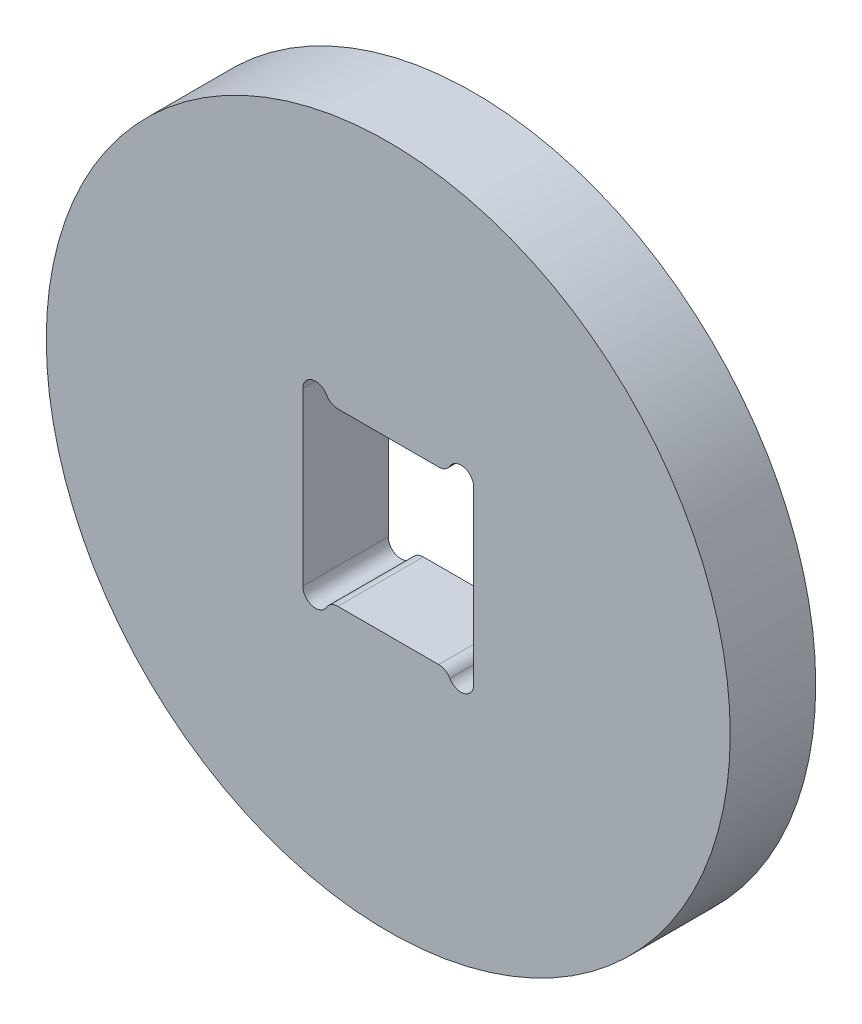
ISO-10303-21;
HEADER;
FILE_DESCRIPTION(('STEP AP214'),'2;1');
FILE_NAME('part.step','',(''),(''),'','','');
FILE_SCHEMA(('AUTOMOTIVE_DESIGN { 1 0 10303 214 1 1 1 1 }'));
ENDSEC;
DATA;
#1=APPLICATION_CONTEXT('core data for automotive mechanical design processes');
#2=APPLICATION_PROTOCOL_DEFINITION('international standard','automotive_design',2000,#1);
#3=PRODUCT_CONTEXT('',#1,'mechanical');
#4=PRODUCT('Part','Part','',(#3));
#5=PRODUCT_RELATED_PRODUCT_CATEGORY('part','',(#4));
#6=PRODUCT_DEFINITION_FORMATION('','',#4);
#7=PRODUCT_DEFINITION_CONTEXT('part definition',#1,'design');
#8=PRODUCT_DEFINITION('design','',#6,#7);
#9=PRODUCT_DEFINITION_SHAPE('','',#8);
#10=(LENGTH_UNIT() NAMED_UNIT(*) SI_UNIT(.MILLI.,.METRE.));
#11=(NAMED_UNIT(*) PLANE_ANGLE_UNIT() SI_UNIT($,.RADIAN.));
#12=(NAMED_UNIT(*) SI_UNIT($,.STERADIAN.) SOLID_ANGLE_UNIT());
#13=UNCERTAINTY_MEASURE_WITH_UNIT(LENGTH_MEASURE(1.E-05),#10,'distance_accuracy_value','');
#14=(GEOMETRIC_REPRESENTATION_CONTEXT(3) GLOBAL_UNCERTAINTY_ASSIGNED_CONTEXT((#13)) GLOBAL_UNIT_ASSIGNED_CONTEXT((#10,
#11,#12)) REPRESENTATION_CONTEXT('',''));
#15=CARTESIAN_POINT('',(0.,0.,0.));
#16=DIRECTION('',(0.,0.,1.));
#17=DIRECTION('',(1.,0.,0.));
#18=AXIS2_PLACEMENT_3D('',#15,#16,#17);
#19=CARTESIAN_POINT('',(0.,0.,10.));
#20=DIRECTION('',(0.,0.,1.));
#21=DIRECTION('',(1.,0.,0.));
#22=AXIS2_PLACEMENT_3D('',#19,#20,#21);
#23=PLANE('',#22);
#24=CARTESIAN_POINT('',(0.,0.,10.));
#25=DIRECTION('',(0.,0.,1.));
#26=DIRECTION('',(1.,0.,0.));
#27=AXIS2_PLACEMENT_3D('',#24,#25,#26);
#28=CIRCLE('',#27,40.);
#29=CARTESIAN_POINT('',(40.,0.,10.));
#30=VERTEX_POINT('',#29);
#31=EDGE_CURVE('E11',#30,#30,#28,.T.);
#32=ORIENTED_EDGE('',*,*,#31,.T.);
#33=EDGE_LOOP('',(#32));
#34=FACE_BOUND('',#33,.T.);
#35=DIRECTION('',(0.,-1.,0.));
#36=VECTOR('',#35,1.);
#37=CARTESIAN_POINT('',(-10.,-10.0000000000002,10.));
#38=LINE('',#37,#36);
#39=CARTESIAN_POINT('',(-10.,10.,10.));
#40=VERTEX_POINT('',#39);
#41=CARTESIAN_POINT('',(-10.,-10.0000000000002,10.));
#42=VERTEX_POINT('',#41);
#43=EDGE_CURVE('E144',#40,#42,#38,.T.);
#44=ORIENTED_EDGE('',*,*,#43,.F.);
#45=CARTESIAN_POINT('',(-8.5,10.,10.));
#46=DIRECTION('',(0.,0.,1.));
#47=DIRECTION('',(1.,0.,0.));
#48=AXIS2_PLACEMENT_3D('',#45,#46,#47);
#49=CIRCLE('',#48,1.5);
#50=CARTESIAN_POINT('',(-7.20096189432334,10.75,10.));
#51=VERTEX_POINT('',#50);
#52=EDGE_CURVE('E135',#51,#40,#49,.T.);
#53=ORIENTED_EDGE('',*,*,#52,.F.);
#54=CARTESIAN_POINT('',(-5.90192378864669,11.5,10.));
#55=DIRECTION('',(0.,0.,-1.));
#56=DIRECTION('',(1.,0.,0.));
#57=AXIS2_PLACEMENT_3D('',#54,#55,#56);
#58=CIRCLE('',#57,1.5);
#59=CARTESIAN_POINT('',(-5.90192378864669,10.,10.));
#60=VERTEX_POINT('',#59);
#61=EDGE_CURVE('E187',#60,#51,#58,.T.);
#62=ORIENTED_EDGE('',*,*,#61,.F.);
#63=DIRECTION('',(-1.,0.,0.));
#64=VECTOR('',#63,1.);
#65=CARTESIAN_POINT('',(-5.90192378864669,10.,10.));
#66=LINE('',#65,#64);
#67=CARTESIAN_POINT('',(5.90192378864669,10.,10.));
#68=VERTEX_POINT('',#67);
#69=EDGE_CURVE('E184',#68,#60,#66,.T.);
#70=ORIENTED_EDGE('',*,*,#69,.F.);
#71=CARTESIAN_POINT('',(5.90192378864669,11.5,10.));
#72=DIRECTION('',(0.,0.,-1.));
#73=DIRECTION('',(1.,0.,0.));
#74=AXIS2_PLACEMENT_3D('',#71,#72,#73);
#75=CIRCLE('',#74,1.5);
#76=CARTESIAN_POINT('',(7.20096189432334,10.75,10.));
#77=VERTEX_POINT('',#76);
#78=EDGE_CURVE('E181',#77,#68,#75,.T.);
#79=ORIENTED_EDGE('',*,*,#78,.F.);
#80=CARTESIAN_POINT('',(8.5,10.,10.));
#81=DIRECTION('',(0.,0.,1.));
#82=DIRECTION('',(1.,0.,0.));
#83=AXIS2_PLACEMENT_3D('',#80,#81,#82);
#84=CIRCLE('',#83,1.5);
#85=CARTESIAN_POINT('',(10.,10.,10.));
#86=VERTEX_POINT('',#85);
#87=EDGE_CURVE('E178',#86,#77,#84,.T.);
#88=ORIENTED_EDGE('',*,*,#87,.F.);
#89=DIRECTION('',(0.,1.,0.));
#90=VECTOR('',#89,1.);
#91=CARTESIAN_POINT('',(10.,10.,10.));
#92=LINE('',#91,#90);
#93=CARTESIAN_POINT('',(10.,-10.0000000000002,10.));
#94=VERTEX_POINT('',#93);
#95=EDGE_CURVE('E175',#94,#86,#92,.T.);
#96=ORIENTED_EDGE('',*,*,#95,.F.);
#97=CARTESIAN_POINT('',(8.5,-10.0000000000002,10.));
#98=DIRECTION('',(0.,0.,1.));
#99=DIRECTION('',(1.,0.,0.));
#100=AXIS2_PLACEMENT_3D('',#97,#98,#99);
#101=CIRCLE('',#100,1.5);
#102=CARTESIAN_POINT('',(7.20096189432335,-10.7500000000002,10.));
#103=VERTEX_POINT('',#102);
#104=EDGE_CURVE('E172',#103,#94,#101,.T.);
#105=ORIENTED_EDGE('',*,*,#104,.F.);
#106=CARTESIAN_POINT('',(5.90192378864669,-11.5000000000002,10.));
#107=DIRECTION('',(0.,0.,-1.));
#108=DIRECTION('',(1.,0.,0.));
#109=AXIS2_PLACEMENT_3D('',#106,#107,#108);
#110=CIRCLE('',#109,1.5);
#111=CARTESIAN_POINT('',(5.90192378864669,-10.0000000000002,10.));
#112=VERTEX_POINT('',#111);
#113=EDGE_CURVE('E169',#112,#103,#110,.T.);
#114=ORIENTED_EDGE('',*,*,#113,.F.);
#115=DIRECTION('',(1.,0.,0.));
#116=VECTOR('',#115,1.);
#117=CARTESIAN_POINT('',(5.90192378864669,-10.0000000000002,10.));
#118=LINE('',#117,#116);
#119=CARTESIAN_POINT('',(-5.90192378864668,-10.0000000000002,10.));
#120=VERTEX_POINT('',#119);
#121=EDGE_CURVE('E166',#120,#112,#118,.T.);
#122=ORIENTED_EDGE('',*,*,#121,.F.);
#123=CARTESIAN_POINT('',(-5.90192378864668,-11.5000000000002,10.));
#124=DIRECTION('',(0.,0.,-1.));
#125=DIRECTION('',(1.,0.,0.));
#126=AXIS2_PLACEMENT_3D('',#123,#124,#125);
#127=CIRCLE('',#126,1.5);
#128=CARTESIAN_POINT('',(-7.20096189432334,-10.7500000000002,10.));
#129=VERTEX_POINT('',#128);
#130=EDGE_CURVE('E161',#129,#120,#127,.T.);
#131=ORIENTED_EDGE('',*,*,#130,.F.);
#132=CARTESIAN_POINT('',(-8.5,-10.0000000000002,10.));
#133=DIRECTION('',(0.,0.,1.));
#134=DIRECTION('',(1.,0.,0.));
#135=AXIS2_PLACEMENT_3D('',#132,#133,#134);
#136=CIRCLE('',#135,1.5);
#137=EDGE_CURVE('E157',#42,#129,#136,.T.);
#138=ORIENTED_EDGE('',*,*,#137,.F.);
#139=EDGE_LOOP('',(#44,#53,#62,#70,#79,#88,#96,#105,#114,#122,#131,#138));
#140=FACE_BOUND('',#139,.T.);
#141=ADVANCED_FACE('F45',(#34,#140),#23,.T.);
#142=CARTESIAN_POINT('',(0.,0.,0.));
#143=DIRECTION('',(0.,0.,1.));
#144=DIRECTION('',(1.,0.,0.));
#145=AXIS2_PLACEMENT_3D('',#142,#143,#144);
#146=PLANE('',#145);
#147=CARTESIAN_POINT('',(0.,0.,0.));
#148=DIRECTION('',(0.,0.,1.));
#149=DIRECTION('',(1.,0.,0.));
#150=AXIS2_PLACEMENT_3D('',#147,#148,#149);
#151=CIRCLE('',#150,40.);
#152=CARTESIAN_POINT('',(40.,0.,0.));
#153=VERTEX_POINT('',#152);
#154=EDGE_CURVE('E49',#153,#153,#151,.T.);
#155=ORIENTED_EDGE('',*,*,#154,.F.);
#156=EDGE_LOOP('',(#155));
#157=FACE_BOUND('',#156,.T.);
#158=CARTESIAN_POINT('',(-8.5,10.,0.));
#159=DIRECTION('',(0.,0.,1.));
#160=DIRECTION('',(1.,0.,0.));
#161=AXIS2_PLACEMENT_3D('',#158,#159,#160);
#162=CIRCLE('',#161,1.5);
#163=CARTESIAN_POINT('',(-7.20096189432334,10.75,0.));
#164=VERTEX_POINT('',#163);
#165=CARTESIAN_POINT('',(-10.,10.,0.));
#166=VERTEX_POINT('',#165);
#167=EDGE_CURVE('E69',#164,#166,#162,.T.);
#168=ORIENTED_EDGE('',*,*,#167,.T.);
#169=DIRECTION('',(0.,-1.,0.));
#170=VECTOR('',#169,1.);
#171=CARTESIAN_POINT('',(-10.,-10.0000000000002,0.));
#172=LINE('',#171,#170);
#173=CARTESIAN_POINT('',(-10.,-10.0000000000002,0.));
#174=VERTEX_POINT('',#173);
#175=EDGE_CURVE('E151',#166,#174,#172,.T.);
#176=ORIENTED_EDGE('',*,*,#175,.T.);
#177=CARTESIAN_POINT('',(-8.5,-10.0000000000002,0.));
#178=DIRECTION('',(0.,0.,1.));
#179=DIRECTION('',(1.,0.,0.));
#180=AXIS2_PLACEMENT_3D('',#177,#178,#179);
#181=CIRCLE('',#180,1.5);
#182=CARTESIAN_POINT('',(-7.20096189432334,-10.7500000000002,0.));
#183=VERTEX_POINT('',#182);
#184=EDGE_CURVE('E194',#174,#183,#181,.T.);
#185=ORIENTED_EDGE('',*,*,#184,.T.);
#186=CARTESIAN_POINT('',(-5.90192378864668,-11.5000000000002,0.));
#187=DIRECTION('',(0.,0.,-1.));
#188=DIRECTION('',(1.,0.,0.));
#189=AXIS2_PLACEMENT_3D('',#186,#187,#188);
#190=CIRCLE('',#189,1.5);
#191=CARTESIAN_POINT('',(-5.90192378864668,-10.0000000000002,0.));
#192=VERTEX_POINT('',#191);
#193=EDGE_CURVE('E198',#183,#192,#190,.T.);
#194=ORIENTED_EDGE('',*,*,#193,.T.);
#195=DIRECTION('',(1.,0.,0.));
#196=VECTOR('',#195,1.);
#197=CARTESIAN_POINT('',(5.90192378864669,-10.0000000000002,0.));
#198=LINE('',#197,#196);
#199=CARTESIAN_POINT('',(5.90192378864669,-10.0000000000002,0.));
#200=VERTEX_POINT('',#199);
#201=EDGE_CURVE('E202',#192,#200,#198,.T.);
#202=ORIENTED_EDGE('',*,*,#201,.T.);
#203=CARTESIAN_POINT('',(5.90192378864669,-11.5000000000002,0.));
#204=DIRECTION('',(0.,0.,-1.));
#205=DIRECTION('',(1.,0.,0.));
#206=AXIS2_PLACEMENT_3D('',#203,#204,#205);
#207=CIRCLE('',#206,1.5);
#208=CARTESIAN_POINT('',(7.20096189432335,-10.7500000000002,0.));
#209=VERTEX_POINT('',#208);
#210=EDGE_CURVE('E206',#200,#209,#207,.T.);
#211=ORIENTED_EDGE('',*,*,#210,.T.);
#212=CARTESIAN_POINT('',(8.5,-10.0000000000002,0.));
#213=DIRECTION('',(0.,0.,1.));
#214=DIRECTION('',(1.,0.,0.));
#215=AXIS2_PLACEMENT_3D('',#212,#213,#214);
#216=CIRCLE('',#215,1.5);
#217=CARTESIAN_POINT('',(10.,-10.0000000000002,0.));
#218=VERTEX_POINT('',#217);
#219=EDGE_CURVE('E210',#209,#218,#216,.T.);
#220=ORIENTED_EDGE('',*,*,#219,.T.);
#221=DIRECTION('',(0.,1.,0.));
#222=VECTOR('',#221,1.);
#223=CARTESIAN_POINT('',(10.,10.,0.));
#224=LINE('',#223,#222);
#225=CARTESIAN_POINT('',(10.,10.,0.));
#226=VERTEX_POINT('',#225);
#227=EDGE_CURVE('E214',#218,#226,#224,.T.);
#228=ORIENTED_EDGE('',*,*,#227,.T.);
#229=CARTESIAN_POINT('',(8.5,10.,0.));
#230=DIRECTION('',(0.,0.,1.));
#231=DIRECTION('',(1.,0.,0.));
#232=AXIS2_PLACEMENT_3D('',#229,#230,#231);
#233=CIRCLE('',#232,1.5);
#234=CARTESIAN_POINT('',(7.20096189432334,10.75,0.));
#235=VERTEX_POINT('',#234);
#236=EDGE_CURVE('E218',#226,#235,#233,.T.);
#237=ORIENTED_EDGE('',*,*,#236,.T.);
#238=CARTESIAN_POINT('',(5.90192378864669,11.5,0.));
#239=DIRECTION('',(0.,0.,-1.));
#240=DIRECTION('',(1.,0.,0.));
#241=AXIS2_PLACEMENT_3D('',#238,#239,#240);
#242=CIRCLE('',#241,1.5);
#243=CARTESIAN_POINT('',(5.90192378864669,10.,0.));
#244=VERTEX_POINT('',#243);
#245=EDGE_CURVE('E222',#235,#244,#242,.T.);
#246=ORIENTED_EDGE('',*,*,#245,.T.);
#247=DIRECTION('',(-1.,0.,0.));
#248=VECTOR('',#247,1.);
#249=CARTESIAN_POINT('',(-5.90192378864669,10.,0.));
#250=LINE('',#249,#248);
#251=CARTESIAN_POINT('',(-5.90192378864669,10.,0.));
#252=VERTEX_POINT('',#251);
#253=EDGE_CURVE('E226',#244,#252,#250,.T.);
#254=ORIENTED_EDGE('',*,*,#253,.T.);
#255=CARTESIAN_POINT('',(-5.90192378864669,11.5,0.));
#256=DIRECTION('',(0.,0.,-1.));
#257=DIRECTION('',(1.,0.,0.));
#258=AXIS2_PLACEMENT_3D('',#255,#256,#257);
#259=CIRCLE('',#258,1.5);
#260=EDGE_CURVE('E145',#252,#164,#259,.T.);
#261=ORIENTED_EDGE('',*,*,#260,.T.);
#262=EDGE_LOOP('',(#168,#176,#185,#194,#202,#211,#220,#228,#237,#246,#254,#261));
#263=FACE_BOUND('',#262,.T.);
#264=ADVANCED_FACE('F268',(#157,#263),#146,.F.);
#265=CARTESIAN_POINT('',(0.,0.,10.));
#266=DIRECTION('',(0.,0.,-1.));
#267=DIRECTION('',(-1.,0.,0.));
#268=AXIS2_PLACEMENT_3D('',#265,#266,#267);
#269=CYLINDRICAL_SURFACE('',#268,40.);
#270=ORIENTED_EDGE('',*,*,#31,.F.);
#271=EDGE_LOOP('',(#270));
#272=FACE_BOUND('',#271,.T.);
#273=ORIENTED_EDGE('',*,*,#154,.T.);
#274=EDGE_LOOP('',(#273));
#275=FACE_BOUND('',#274,.T.);
#276=ADVANCED_FACE('F47',(#272,#275),#269,.T.);
#277=CARTESIAN_POINT('',(-8.5,10.,10.));
#278=DIRECTION('',(0.,0.,-1.));
#279=DIRECTION('',(-1.,0.,0.));
#280=AXIS2_PLACEMENT_3D('',#277,#278,#279);
#281=CYLINDRICAL_SURFACE('',#280,1.5);
#282=ORIENTED_EDGE('',*,*,#167,.F.);
#283=DIRECTION('',(0.,0.,-1.));
#284=VECTOR('',#283,1.);
#285=CARTESIAN_POINT('',(-7.20096189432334,10.75,10.));
#286=LINE('',#285,#284);
#287=EDGE_CURVE('E139',#51,#164,#286,.T.);
#288=ORIENTED_EDGE('',*,*,#287,.F.);
#289=ORIENTED_EDGE('',*,*,#52,.T.);
#290=DIRECTION('',(0.,0.,-1.));
#291=VECTOR('',#290,1.);
#292=CARTESIAN_POINT('',(-10.,10.,10.));
#293=LINE('',#292,#291);
#294=EDGE_CURVE('E138',#40,#166,#293,.T.);
#295=ORIENTED_EDGE('',*,*,#294,.T.);
#296=EDGE_LOOP('',(#282,#288,#289,#295));
#297=FACE_BOUND('',#296,.T.);
#298=ADVANCED_FACE('F137',(#297),#281,.F.);
#299=CARTESIAN_POINT('',(-10.,-10.0000000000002,10.));
#300=DIRECTION('',(1.,0.,0.));
#301=DIRECTION('',(0.,1.,0.));
#302=AXIS2_PLACEMENT_3D('',#299,#300,#301);
#303=PLANE('',#302);
#304=ORIENTED_EDGE('',*,*,#175,.F.);
#305=ORIENTED_EDGE('',*,*,#294,.F.);
#306=ORIENTED_EDGE('',*,*,#43,.T.);
#307=DIRECTION('',(0.,0.,-1.));
#308=VECTOR('',#307,1.);
#309=CARTESIAN_POINT('',(-10.,-10.0000000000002,10.));
#310=LINE('',#309,#308);
#311=EDGE_CURVE('E153',#42,#174,#310,.T.);
#312=ORIENTED_EDGE('',*,*,#311,.T.);
#313=EDGE_LOOP('',(#304,#305,#306,#312));
#314=FACE_BOUND('',#313,.T.);
#315=ADVANCED_FACE('F148',(#314),#303,.T.);
#316=CARTESIAN_POINT('',(-8.5,-10.0000000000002,10.));
#317=DIRECTION('',(0.,0.,-1.));
#318=DIRECTION('',(-1.,0.,0.));
#319=AXIS2_PLACEMENT_3D('',#316,#317,#318);
#320=CYLINDRICAL_SURFACE('',#319,1.5);
#321=ORIENTED_EDGE('',*,*,#184,.F.);
#322=ORIENTED_EDGE('',*,*,#311,.F.);
#323=ORIENTED_EDGE('',*,*,#137,.T.);
#324=DIRECTION('',(0.,0.,-1.));
#325=VECTOR('',#324,1.);
#326=CARTESIAN_POINT('',(-7.20096189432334,-10.7500000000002,10.));
#327=LINE('',#326,#325);
#328=EDGE_CURVE('E258',#129,#183,#327,.T.);
#329=ORIENTED_EDGE('',*,*,#328,.T.);
#330=EDGE_LOOP('',(#321,#322,#323,#329));
#331=FACE_BOUND('',#330,.T.);
#332=ADVANCED_FACE('F264',(#331),#320,.F.);
#333=CARTESIAN_POINT('',(-5.90192378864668,-11.5000000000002,10.));
#334=DIRECTION('',(0.,0.,-1.));
#335=DIRECTION('',(-1.,0.,0.));
#336=AXIS2_PLACEMENT_3D('',#333,#334,#335);
#337=CYLINDRICAL_SURFACE('',#336,1.5);
#338=ORIENTED_EDGE('',*,*,#193,.F.);
#339=ORIENTED_EDGE('',*,*,#328,.F.);
#340=ORIENTED_EDGE('',*,*,#130,.T.);
#341=DIRECTION('',(0.,0.,-1.));
#342=VECTOR('',#341,1.);
#343=CARTESIAN_POINT('',(-5.90192378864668,-10.0000000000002,10.));
#344=LINE('',#343,#342);
#345=EDGE_CURVE('E255',#120,#192,#344,.T.);
#346=ORIENTED_EDGE('',*,*,#345,.T.);
#347=EDGE_LOOP('',(#338,#339,#340,#346));
#348=FACE_BOUND('',#347,.T.);
#349=ADVANCED_FACE('F306',(#348),#337,.T.);
#350=CARTESIAN_POINT('',(5.90192378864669,-10.0000000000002,10.));
#351=DIRECTION('',(0.,1.,0.));
#352=DIRECTION('',(-1.,0.,0.));
#353=AXIS2_PLACEMENT_3D('',#350,#351,#352);
#354=PLANE('',#353);
#355=ORIENTED_EDGE('',*,*,#201,.F.);
#356=ORIENTED_EDGE('',*,*,#345,.F.);
#357=ORIENTED_EDGE('',*,*,#121,.T.);
#358=DIRECTION('',(0.,0.,-1.));
#359=VECTOR('',#358,1.);
#360=CARTESIAN_POINT('',(5.90192378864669,-10.0000000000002,10.));
#361=LINE('',#360,#359);
#362=EDGE_CURVE('E252',#112,#200,#361,.T.);
#363=ORIENTED_EDGE('',*,*,#362,.T.);
#364=EDGE_LOOP('',(#355,#356,#357,#363));
#365=FACE_BOUND('',#364,.T.);
#366=ADVANCED_FACE('F304',(#365),#354,.T.);
#367=CARTESIAN_POINT('',(5.90192378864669,-11.5000000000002,10.));
#368=DIRECTION('',(0.,0.,-1.));
#369=DIRECTION('',(-1.,0.,0.));
#370=AXIS2_PLACEMENT_3D('',#367,#368,#369);
#371=CYLINDRICAL_SURFACE('',#370,1.5);
#372=ORIENTED_EDGE('',*,*,#210,.F.);
#373=ORIENTED_EDGE('',*,*,#362,.F.);
#374=ORIENTED_EDGE('',*,*,#113,.T.);
#375=DIRECTION('',(0.,0.,-1.));
#376=VECTOR('',#375,1.);
#377=CARTESIAN_POINT('',(7.20096189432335,-10.7500000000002,10.));
#378=LINE('',#377,#376);
#379=EDGE_CURVE('E249',#103,#209,#378,.T.);
#380=ORIENTED_EDGE('',*,*,#379,.T.);
#381=EDGE_LOOP('',(#372,#373,#374,#380));
#382=FACE_BOUND('',#381,.T.);
#383=ADVANCED_FACE('F298',(#382),#371,.T.);
#384=CARTESIAN_POINT('',(8.5,-10.0000000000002,10.));
#385=DIRECTION('',(0.,0.,-1.));
#386=DIRECTION('',(-1.,0.,0.));
#387=AXIS2_PLACEMENT_3D('',#384,#385,#386);
#388=CYLINDRICAL_SURFACE('',#387,1.5);
#389=ORIENTED_EDGE('',*,*,#219,.F.);
#390=ORIENTED_EDGE('',*,*,#379,.F.);
#391=ORIENTED_EDGE('',*,*,#104,.T.);
#392=DIRECTION('',(0.,0.,-1.));
#393=VECTOR('',#392,1.);
#394=CARTESIAN_POINT('',(10.,-10.0000000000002,10.));
#395=LINE('',#394,#393);
#396=EDGE_CURVE('E246',#94,#218,#395,.T.);
#397=ORIENTED_EDGE('',*,*,#396,.T.);
#398=EDGE_LOOP('',(#389,#390,#391,#397));
#399=FACE_BOUND('',#398,.T.);
#400=ADVANCED_FACE('F294',(#399),#388,.F.);
#401=CARTESIAN_POINT('',(10.,10.,10.));
#402=DIRECTION('',(-1.,0.,0.));
#403=DIRECTION('',(0.,-1.,0.));
#404=AXIS2_PLACEMENT_3D('',#401,#402,#403);
#405=PLANE('',#404);
#406=ORIENTED_EDGE('',*,*,#227,.F.);
#407=ORIENTED_EDGE('',*,*,#396,.F.);
#408=ORIENTED_EDGE('',*,*,#95,.T.);
#409=DIRECTION('',(0.,0.,-1.));
#410=VECTOR('',#409,1.);
#411=CARTESIAN_POINT('',(10.,10.,10.));
#412=LINE('',#411,#410);
#413=EDGE_CURVE('E243',#86,#226,#412,.T.);
#414=ORIENTED_EDGE('',*,*,#413,.T.);
#415=EDGE_LOOP('',(#406,#407,#408,#414));
#416=FACE_BOUND('',#415,.T.);
#417=ADVANCED_FACE('F291',(#416),#405,.T.);
#418=CARTESIAN_POINT('',(8.5,10.,10.));
#419=DIRECTION('',(0.,0.,-1.));
#420=DIRECTION('',(-1.,0.,0.));
#421=AXIS2_PLACEMENT_3D('',#418,#419,#420);
#422=CYLINDRICAL_SURFACE('',#421,1.5);
#423=ORIENTED_EDGE('',*,*,#236,.F.);
#424=ORIENTED_EDGE('',*,*,#413,.F.);
#425=ORIENTED_EDGE('',*,*,#87,.T.);
#426=DIRECTION('',(0.,0.,-1.));
#427=VECTOR('',#426,1.);
#428=CARTESIAN_POINT('',(7.20096189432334,10.75,10.));
#429=LINE('',#428,#427);
#430=EDGE_CURVE('E240',#77,#235,#429,.T.);
#431=ORIENTED_EDGE('',*,*,#430,.T.);
#432=EDGE_LOOP('',(#423,#424,#425,#431));
#433=FACE_BOUND('',#432,.T.);
#434=ADVANCED_FACE('F283',(#433),#422,.F.);
#435=CARTESIAN_POINT('',(5.90192378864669,11.5,10.));
#436=DIRECTION('',(0.,0.,-1.));
#437=DIRECTION('',(-1.,0.,0.));
#438=AXIS2_PLACEMENT_3D('',#435,#436,#437);
#439=CYLINDRICAL_SURFACE('',#438,1.5);
#440=ORIENTED_EDGE('',*,*,#245,.F.);
#441=ORIENTED_EDGE('',*,*,#430,.F.);
#442=ORIENTED_EDGE('',*,*,#78,.T.);
#443=DIRECTION('',(0.,0.,-1.));
#444=VECTOR('',#443,1.);
#445=CARTESIAN_POINT('',(5.90192378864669,10.,10.));
#446=LINE('',#445,#444);
#447=EDGE_CURVE('E237',#68,#244,#446,.T.);
#448=ORIENTED_EDGE('',*,*,#447,.T.);
#449=EDGE_LOOP('',(#440,#441,#442,#448));
#450=FACE_BOUND('',#449,.T.);
#451=ADVANCED_FACE('F279',(#450),#439,.T.);
#452=CARTESIAN_POINT('',(-5.90192378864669,10.,10.));
#453=DIRECTION('',(0.,-1.,0.));
#454=DIRECTION('',(0.,0.,-1.));
#455=AXIS2_PLACEMENT_3D('',#452,#453,#454);
#456=PLANE('',#455);
#457=ORIENTED_EDGE('',*,*,#253,.F.);
#458=ORIENTED_EDGE('',*,*,#447,.F.);
#459=ORIENTED_EDGE('',*,*,#69,.T.);
#460=DIRECTION('',(0.,0.,-1.));
#461=VECTOR('',#460,1.);
#462=CARTESIAN_POINT('',(-5.90192378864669,10.,10.));
#463=LINE('',#462,#461);
#464=EDGE_CURVE('E61',#60,#252,#463,.T.);
#465=ORIENTED_EDGE('',*,*,#464,.T.);
#466=EDGE_LOOP('',(#457,#458,#459,#465));
#467=FACE_BOUND('',#466,.T.);
#468=ADVANCED_FACE('F276',(#467),#456,.T.);
#469=CARTESIAN_POINT('',(-5.90192378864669,11.5,10.));
#470=DIRECTION('',(0.,0.,-1.));
#471=DIRECTION('',(-1.,0.,0.));
#472=AXIS2_PLACEMENT_3D('',#469,#470,#471);
#473=CYLINDRICAL_SURFACE('',#472,1.5);
#474=ORIENTED_EDGE('',*,*,#260,.F.);
#475=ORIENTED_EDGE('',*,*,#464,.F.);
#476=ORIENTED_EDGE('',*,*,#61,.T.);
#477=ORIENTED_EDGE('',*,*,#287,.T.);
#478=EDGE_LOOP('',(#474,#475,#476,#477));
#479=FACE_BOUND('',#478,.T.);
#480=ADVANCED_FACE('F270',(#479),#473,.T.);
#481=CLOSED_SHELL('',(#141,#264,#276,#298,#315,#332,#349,#366,#383,#400,#417,#434,#451,#468,#480));
#482=MANIFOLD_SOLID_BREP('B2',#481);
#483=ADVANCED_BREP_SHAPE_REPRESENTATION('',(#18,#482),#14);
#484=SHAPE_DEFINITION_REPRESENTATION(#9,#483);
ENDSEC;
END-ISO-10303-21;
